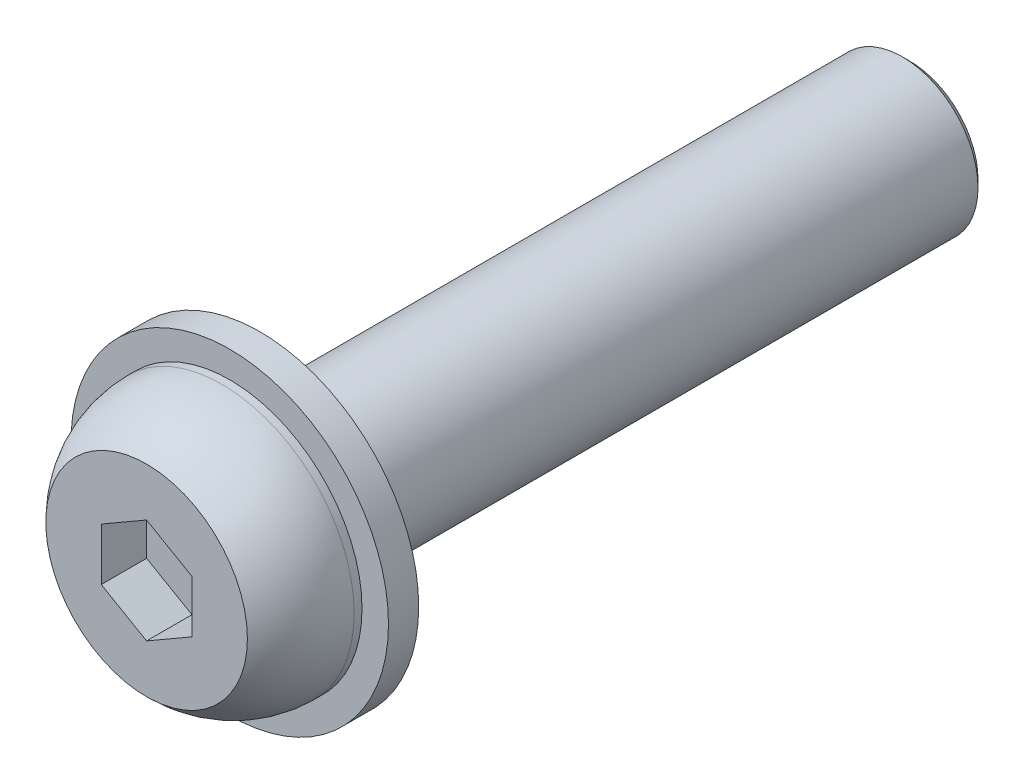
ISO-10303-21;
HEADER;
FILE_DESCRIPTION(('STEP AP214'),'2;1');
FILE_NAME('part.step','',(''),(''),'','','');
FILE_SCHEMA(('AUTOMOTIVE_DESIGN { 1 0 10303 214 1 1 1 1 }'));
ENDSEC;
DATA;
#1=APPLICATION_CONTEXT('core data for automotive mechanical design processes');
#2=APPLICATION_PROTOCOL_DEFINITION('international standard','automotive_design',2000,#1);
#3=PRODUCT_CONTEXT('',#1,'mechanical');
#4=PRODUCT('Part','Part','',(#3));
#5=PRODUCT_RELATED_PRODUCT_CATEGORY('part','',(#4));
#6=PRODUCT_DEFINITION_FORMATION('','',#4);
#7=PRODUCT_DEFINITION_CONTEXT('part definition',#1,'design');
#8=PRODUCT_DEFINITION('design','',#6,#7);
#9=PRODUCT_DEFINITION_SHAPE('','',#8);
#10=(LENGTH_UNIT() NAMED_UNIT(*) SI_UNIT(.MILLI.,.METRE.));
#11=(NAMED_UNIT(*) PLANE_ANGLE_UNIT() SI_UNIT($,.RADIAN.));
#12=(NAMED_UNIT(*) SI_UNIT($,.STERADIAN.) SOLID_ANGLE_UNIT());
#13=UNCERTAINTY_MEASURE_WITH_UNIT(LENGTH_MEASURE(1.E-05),#10,'distance_accuracy_value','');
#14=(GEOMETRIC_REPRESENTATION_CONTEXT(3) GLOBAL_UNCERTAINTY_ASSIGNED_CONTEXT((#13)) GLOBAL_UNIT_ASSIGNED_CONTEXT((#10,
#11,#12)) REPRESENTATION_CONTEXT('',''));
#15=CARTESIAN_POINT('',(0.,0.,0.));
#16=DIRECTION('',(0.,0.,1.));
#17=DIRECTION('',(1.,0.,0.));
#18=AXIS2_PLACEMENT_3D('',#15,#16,#17);
#19=CARTESIAN_POINT('',(0.,0.,2.));
#20=DIRECTION('',(0.,0.,-1.));
#21=DIRECTION('',(-1.,0.,0.));
#22=AXIS2_PLACEMENT_3D('',#19,#20,#21);
#23=CYLINDRICAL_SURFACE('',#22,10.5);
#24=CARTESIAN_POINT('',(0.,0.,2.));
#25=DIRECTION('',(0.,0.,1.));
#26=DIRECTION('',(1.,0.,0.));
#27=AXIS2_PLACEMENT_3D('',#24,#25,#26);
#28=CIRCLE('',#27,10.5);
#29=CARTESIAN_POINT('',(10.5,0.,2.));
#30=VERTEX_POINT('',#29);
#31=EDGE_CURVE('E23',#30,#30,#28,.T.);
#32=ORIENTED_EDGE('',*,*,#31,.F.);
#33=EDGE_LOOP('',(#32));
#34=FACE_BOUND('',#33,.T.);
#35=CARTESIAN_POINT('',(0.,0.,0.));
#36=DIRECTION('',(0.,0.,1.));
#37=DIRECTION('',(1.,0.,0.));
#38=AXIS2_PLACEMENT_3D('',#35,#36,#37);
#39=CIRCLE('',#38,10.5);
#40=CARTESIAN_POINT('',(10.5,0.,0.));
#41=VERTEX_POINT('',#40);
#42=EDGE_CURVE('E147',#41,#41,#39,.T.);
#43=ORIENTED_EDGE('',*,*,#42,.T.);
#44=EDGE_LOOP('',(#43));
#45=FACE_BOUND('',#44,.T.);
#46=ADVANCED_FACE('F14',(#34,#45),#23,.T.);
#47=CARTESIAN_POINT('',(0.,0.,2.));
#48=DIRECTION('',(0.,0.,1.));
#49=DIRECTION('',(1.,0.,0.));
#50=AXIS2_PLACEMENT_3D('',#47,#48,#49);
#51=PLANE('',#50);
#52=ORIENTED_EDGE('',*,*,#31,.T.);
#53=EDGE_LOOP('',(#52));
#54=FACE_BOUND('',#53,.T.);
#55=CARTESIAN_POINT('',(0.,0.,2.));
#56=DIRECTION('',(0.,0.,1.));
#57=DIRECTION('',(1.,0.,0.));
#58=AXIS2_PLACEMENT_3D('',#55,#56,#57);
#59=CIRCLE('',#58,8.75);
#60=CARTESIAN_POINT('',(8.75,0.,2.));
#61=VERTEX_POINT('',#60);
#62=EDGE_CURVE('E9',#61,#61,#59,.F.);
#63=ORIENTED_EDGE('',*,*,#62,.T.);
#64=EDGE_LOOP('',(#63));
#65=FACE_BOUND('',#64,.T.);
#66=ADVANCED_FACE('F155',(#54,#65),#51,.T.);
#67=CARTESIAN_POINT('',(0.,0.,0.));
#68=DIRECTION('',(0.,0.,1.));
#69=DIRECTION('',(1.,0.,0.));
#70=AXIS2_PLACEMENT_3D('',#67,#68,#69);
#71=PLANE('',#70);
#72=ORIENTED_EDGE('',*,*,#42,.F.);
#73=EDGE_LOOP('',(#72));
#74=FACE_BOUND('',#73,.T.);
#75=CARTESIAN_POINT('',(0.,0.,0.));
#76=DIRECTION('',(0.,0.,1.));
#77=DIRECTION('',(1.,0.,0.));
#78=AXIS2_PLACEMENT_3D('',#75,#76,#77);
#79=CIRCLE('',#78,5.25);
#80=CARTESIAN_POINT('',(5.25,0.,0.));
#81=VERTEX_POINT('',#80);
#82=EDGE_CURVE('E138',#81,#81,#79,.T.);
#83=ORIENTED_EDGE('',*,*,#82,.T.);
#84=EDGE_LOOP('',(#83));
#85=FACE_BOUND('',#84,.T.);
#86=ADVANCED_FACE('F163',(#74,#85),#71,.F.);
#87=CARTESIAN_POINT('',(0.,0.,2.));
#88=DIRECTION('',(0.,0.,-1.));
#89=DIRECTION('',(-1.,0.,0.));
#90=AXIS2_PLACEMENT_3D('',#87,#88,#89);
#91=CYLINDRICAL_SURFACE('',#90,5.25);
#92=CARTESIAN_POINT('',(0.,0.,2.));
#93=DIRECTION('',(0.,0.,1.));
#94=DIRECTION('',(1.,0.,0.));
#95=AXIS2_PLACEMENT_3D('',#92,#93,#94);
#96=CIRCLE('',#95,5.25);
#97=CARTESIAN_POINT('',(5.25,0.,2.));
#98=VERTEX_POINT('',#97);
#99=EDGE_CURVE('E142',#98,#98,#96,.T.);
#100=ORIENTED_EDGE('',*,*,#99,.T.);
#101=EDGE_LOOP('',(#100));
#102=FACE_BOUND('',#101,.T.);
#103=ORIENTED_EDGE('',*,*,#82,.F.);
#104=EDGE_LOOP('',(#103));
#105=FACE_BOUND('',#104,.T.);
#106=ADVANCED_FACE('F165',(#102,#105),#91,.F.);
#107=CARTESIAN_POINT('',(-5.,0.,-43.));
#108=DIRECTION('',(0.,0.,1.));
#109=DIRECTION('',(1.,0.,0.));
#110=AXIS2_PLACEMENT_3D('',#107,#108,#109);
#111=PLANE('',#110);
#112=CARTESIAN_POINT('',(0.,0.,-43.));
#113=DIRECTION('',(0.,0.,1.));
#114=DIRECTION('',(1.,0.,0.));
#115=AXIS2_PLACEMENT_3D('',#112,#113,#114);
#116=CIRCLE('',#115,4.5);
#117=CARTESIAN_POINT('',(4.5,0.,-43.));
#118=VERTEX_POINT('',#117);
#119=EDGE_CURVE('E18',#118,#118,#116,.F.);
#120=ORIENTED_EDGE('',*,*,#119,.T.);
#121=EDGE_LOOP('',(#120));
#122=FACE_BOUND('',#121,.T.);
#123=ADVANCED_FACE('F173',(#122),#111,.F.);
#124=CARTESIAN_POINT('',(0.,0.,-42.5));
#125=DIRECTION('',(0.,0.,1.));
#126=DIRECTION('',(1.,0.,0.));
#127=AXIS2_PLACEMENT_3D('',#124,#125,#126);
#128=CONICAL_SURFACE('',#127,5.,0.785398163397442);
#129=ORIENTED_EDGE('',*,*,#119,.F.);
#130=EDGE_LOOP('',(#129));
#131=FACE_BOUND('',#130,.T.);
#132=CARTESIAN_POINT('',(0.,0.,-42.5));
#133=DIRECTION('',(0.,0.,1.));
#134=DIRECTION('',(1.,0.,0.));
#135=AXIS2_PLACEMENT_3D('',#132,#133,#134);
#136=CIRCLE('',#135,5.);
#137=CARTESIAN_POINT('',(5.,0.,-42.5));
#138=VERTEX_POINT('',#137);
#139=EDGE_CURVE('E133',#138,#138,#136,.T.);
#140=ORIENTED_EDGE('',*,*,#139,.F.);
#141=EDGE_LOOP('',(#140));
#142=FACE_BOUND('',#141,.T.);
#143=ADVANCED_FACE('F176',(#131,#142),#128,.T.);
#144=CARTESIAN_POINT('',(0.,0.,7.5));
#145=DIRECTION('',(0.,0.,1.));
#146=DIRECTION('',(1.,0.,0.));
#147=AXIS2_PLACEMENT_3D('',#144,#145,#146);
#148=CYLINDRICAL_SURFACE('',#147,5.);
#149=ORIENTED_EDGE('',*,*,#139,.T.);
#150=EDGE_LOOP('',(#149));
#151=FACE_BOUND('',#150,.T.);
#152=CARTESIAN_POINT('',(0.,0.,2.));
#153=DIRECTION('',(0.,0.,1.));
#154=DIRECTION('',(1.,0.,0.));
#155=AXIS2_PLACEMENT_3D('',#152,#153,#154);
#156=CIRCLE('',#155,5.);
#157=CARTESIAN_POINT('',(5.,0.,2.));
#158=VERTEX_POINT('',#157);
#159=EDGE_CURVE('E119',#158,#158,#156,.T.);
#160=ORIENTED_EDGE('',*,*,#159,.F.);
#161=EDGE_LOOP('',(#160));
#162=FACE_BOUND('',#161,.T.);
#163=ADVANCED_FACE('F203',(#151,#162),#148,.T.);
#164=CARTESIAN_POINT('',(-5.,0.,2.));
#165=DIRECTION('',(0.,0.,1.));
#166=DIRECTION('',(1.,0.,0.));
#167=AXIS2_PLACEMENT_3D('',#164,#165,#166);
#168=PLANE('',#167);
#169=ORIENTED_EDGE('',*,*,#99,.F.);
#170=EDGE_LOOP('',(#169));
#171=FACE_BOUND('',#170,.T.);
#172=ORIENTED_EDGE('',*,*,#159,.T.);
#173=EDGE_LOOP('',(#172));
#174=FACE_BOUND('',#173,.T.);
#175=ADVANCED_FACE('F16',(#171,#174),#168,.F.);
#176=CARTESIAN_POINT('',(-3.,5.19615242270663,4.5));
#177=DIRECTION('',(0.,0.,1.));
#178=DIRECTION('',(1.,0.,0.));
#179=AXIS2_PLACEMENT_3D('',#176,#177,#178);
#180=PLANE('',#179);
#181=DIRECTION('',(-0.866025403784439,0.5,0.));
#182=VECTOR('',#181,1.);
#183=CARTESIAN_POINT('',(3.,1.73205080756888,4.5));
#184=LINE('',#183,#182);
#185=CARTESIAN_POINT('',(3.,1.73205080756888,4.5));
#186=VERTEX_POINT('',#185);
#187=CARTESIAN_POINT('',(0.,3.46410161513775,4.5));
#188=VERTEX_POINT('',#187);
#189=EDGE_CURVE('E103',#186,#188,#184,.T.);
#190=ORIENTED_EDGE('',*,*,#189,.T.);
#191=DIRECTION('',(-0.866025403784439,-0.5,0.));
#192=VECTOR('',#191,1.);
#193=CARTESIAN_POINT('',(0.,3.46410161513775,4.5));
#194=LINE('',#193,#192);
#195=CARTESIAN_POINT('',(-3.,1.73205080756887,4.5));
#196=VERTEX_POINT('',#195);
#197=EDGE_CURVE('E106',#188,#196,#194,.T.);
#198=ORIENTED_EDGE('',*,*,#197,.T.);
#199=DIRECTION('',(0.,-1.,0.));
#200=VECTOR('',#199,1.);
#201=CARTESIAN_POINT('',(-3.,1.73205080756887,4.5));
#202=LINE('',#201,#200);
#203=CARTESIAN_POINT('',(-3.,-1.73205080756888,4.5));
#204=VERTEX_POINT('',#203);
#205=EDGE_CURVE('E77',#196,#204,#202,.T.);
#206=ORIENTED_EDGE('',*,*,#205,.T.);
#207=DIRECTION('',(0.866025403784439,-0.5,0.));
#208=VECTOR('',#207,1.);
#209=CARTESIAN_POINT('',(-3.,-1.73205080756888,4.5));
#210=LINE('',#209,#208);
#211=CARTESIAN_POINT('',(0.,-3.46410161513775,4.5));
#212=VERTEX_POINT('',#211);
#213=EDGE_CURVE('E109',#204,#212,#210,.T.);
#214=ORIENTED_EDGE('',*,*,#213,.T.);
#215=DIRECTION('',(0.866025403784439,0.5,0.));
#216=VECTOR('',#215,1.);
#217=CARTESIAN_POINT('',(0.,-3.46410161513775,4.5));
#218=LINE('',#217,#216);
#219=CARTESIAN_POINT('',(3.,-1.73205080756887,4.5));
#220=VERTEX_POINT('',#219);
#221=EDGE_CURVE('E112',#212,#220,#218,.T.);
#222=ORIENTED_EDGE('',*,*,#221,.T.);
#223=DIRECTION('',(0.,1.,0.));
#224=VECTOR('',#223,1.);
#225=CARTESIAN_POINT('',(3.,-1.73205080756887,4.5));
#226=LINE('',#225,#224);
#227=EDGE_CURVE('E115',#220,#186,#226,.T.);
#228=ORIENTED_EDGE('',*,*,#227,.T.);
#229=EDGE_LOOP('',(#190,#198,#206,#214,#222,#228));
#230=FACE_BOUND('',#229,.T.);
#231=ADVANCED_FACE('F179',(#230),#180,.T.);
#232=CARTESIAN_POINT('',(-3.,1.73205080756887,4.5));
#233=DIRECTION('',(-1.,0.,0.));
#234=DIRECTION('',(0.,-1.,0.));
#235=AXIS2_PLACEMENT_3D('',#232,#233,#234);
#236=PLANE('',#235);
#237=DIRECTION('',(0.,-1.,0.));
#238=VECTOR('',#237,1.);
#239=CARTESIAN_POINT('',(-3.,1.73205080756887,7.5));
#240=LINE('',#239,#238);
#241=CARTESIAN_POINT('',(-3.,1.73205080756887,7.5));
#242=VERTEX_POINT('',#241);
#243=CARTESIAN_POINT('',(-3.,-1.73205080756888,7.5));
#244=VERTEX_POINT('',#243);
#245=EDGE_CURVE('E74',#242,#244,#240,.T.);
#246=ORIENTED_EDGE('',*,*,#245,.T.);
#247=DIRECTION('',(0.,0.,1.));
#248=VECTOR('',#247,1.);
#249=CARTESIAN_POINT('',(-3.,-1.73205080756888,4.5));
#250=LINE('',#249,#248);
#251=EDGE_CURVE('E81',#204,#244,#250,.T.);
#252=ORIENTED_EDGE('',*,*,#251,.F.);
#253=ORIENTED_EDGE('',*,*,#205,.F.);
#254=DIRECTION('',(0.,0.,1.));
#255=VECTOR('',#254,1.);
#256=CARTESIAN_POINT('',(-3.,1.73205080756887,4.5));
#257=LINE('',#256,#255);
#258=EDGE_CURVE('E70',#196,#242,#257,.T.);
#259=ORIENTED_EDGE('',*,*,#258,.T.);
#260=EDGE_LOOP('',(#246,#252,#253,#259));
#261=FACE_BOUND('',#260,.T.);
#262=ADVANCED_FACE('F72',(#261),#236,.F.);
#263=CARTESIAN_POINT('',(-3.,-1.73205080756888,4.5));
#264=DIRECTION('',(-0.5,-0.866025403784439,0.));
#265=DIRECTION('',(0.866025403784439,-0.5,0.));
#266=AXIS2_PLACEMENT_3D('',#263,#264,#265);
#267=PLANE('',#266);
#268=DIRECTION('',(0.866025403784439,-0.5,0.));
#269=VECTOR('',#268,1.);
#270=CARTESIAN_POINT('',(-3.,-1.73205080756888,7.5));
#271=LINE('',#270,#269);
#272=CARTESIAN_POINT('',(0.,-3.46410161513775,7.5));
#273=VERTEX_POINT('',#272);
#274=EDGE_CURVE('E93',#244,#273,#271,.T.);
#275=ORIENTED_EDGE('',*,*,#274,.T.);
#276=DIRECTION('',(0.,0.,1.));
#277=VECTOR('',#276,1.);
#278=CARTESIAN_POINT('',(0.,-3.46410161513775,4.5));
#279=LINE('',#278,#277);
#280=EDGE_CURVE('E122',#212,#273,#279,.T.);
#281=ORIENTED_EDGE('',*,*,#280,.F.);
#282=ORIENTED_EDGE('',*,*,#213,.F.);
#283=ORIENTED_EDGE('',*,*,#251,.T.);
#284=EDGE_LOOP('',(#275,#281,#282,#283));
#285=FACE_BOUND('',#284,.T.);
#286=ADVANCED_FACE('F190',(#285),#267,.F.);
#287=CARTESIAN_POINT('',(0.,-3.46410161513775,4.5));
#288=DIRECTION('',(0.5,-0.866025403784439,0.));
#289=DIRECTION('',(0.866025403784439,0.5,0.));
#290=AXIS2_PLACEMENT_3D('',#287,#288,#289);
#291=PLANE('',#290);
#292=DIRECTION('',(0.866025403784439,0.5,0.));
#293=VECTOR('',#292,1.);
#294=CARTESIAN_POINT('',(0.,-3.46410161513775,7.5));
#295=LINE('',#294,#293);
#296=CARTESIAN_POINT('',(3.,-1.73205080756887,7.5));
#297=VERTEX_POINT('',#296);
#298=EDGE_CURVE('E95',#273,#297,#295,.T.);
#299=ORIENTED_EDGE('',*,*,#298,.T.);
#300=DIRECTION('',(0.,0.,1.));
#301=VECTOR('',#300,1.);
#302=CARTESIAN_POINT('',(3.,-1.73205080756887,4.5));
#303=LINE('',#302,#301);
#304=EDGE_CURVE('E120',#220,#297,#303,.T.);
#305=ORIENTED_EDGE('',*,*,#304,.F.);
#306=ORIENTED_EDGE('',*,*,#221,.F.);
#307=ORIENTED_EDGE('',*,*,#280,.T.);
#308=EDGE_LOOP('',(#299,#305,#306,#307));
#309=FACE_BOUND('',#308,.T.);
#310=ADVANCED_FACE('F187',(#309),#291,.F.);
#311=CARTESIAN_POINT('',(3.,-1.73205080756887,4.5));
#312=DIRECTION('',(1.,0.,0.));
#313=DIRECTION('',(0.,1.,0.));
#314=AXIS2_PLACEMENT_3D('',#311,#312,#313);
#315=PLANE('',#314);
#316=DIRECTION('',(0.,1.,0.));
#317=VECTOR('',#316,1.);
#318=CARTESIAN_POINT('',(3.,-1.73205080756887,7.5));
#319=LINE('',#318,#317);
#320=CARTESIAN_POINT('',(3.,1.73205080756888,7.5));
#321=VERTEX_POINT('',#320);
#322=EDGE_CURVE('E101',#297,#321,#319,.T.);
#323=ORIENTED_EDGE('',*,*,#322,.T.);
#324=DIRECTION('',(0.,0.,1.));
#325=VECTOR('',#324,1.);
#326=CARTESIAN_POINT('',(3.,1.73205080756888,4.5));
#327=LINE('',#326,#325);
#328=EDGE_CURVE('E38',#186,#321,#327,.T.);
#329=ORIENTED_EDGE('',*,*,#328,.F.);
#330=ORIENTED_EDGE('',*,*,#227,.F.);
#331=ORIENTED_EDGE('',*,*,#304,.T.);
#332=EDGE_LOOP('',(#323,#329,#330,#331));
#333=FACE_BOUND('',#332,.T.);
#334=ADVANCED_FACE('F183',(#333),#315,.F.);
#335=CARTESIAN_POINT('',(3.,1.73205080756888,4.5));
#336=DIRECTION('',(0.5,0.866025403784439,0.));
#337=DIRECTION('',(-0.866025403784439,0.5,0.));
#338=AXIS2_PLACEMENT_3D('',#335,#336,#337);
#339=PLANE('',#338);
#340=DIRECTION('',(-0.866025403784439,0.5,0.));
#341=VECTOR('',#340,1.);
#342=CARTESIAN_POINT('',(3.,1.73205080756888,7.5));
#343=LINE('',#342,#341);
#344=CARTESIAN_POINT('',(0.,3.46410161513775,7.5));
#345=VERTEX_POINT('',#344);
#346=EDGE_CURVE('E31',#321,#345,#343,.T.);
#347=ORIENTED_EDGE('',*,*,#346,.T.);
#348=DIRECTION('',(0.,0.,1.));
#349=VECTOR('',#348,1.);
#350=CARTESIAN_POINT('',(0.,3.46410161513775,4.5));
#351=LINE('',#350,#349);
#352=EDGE_CURVE('E82',#188,#345,#351,.T.);
#353=ORIENTED_EDGE('',*,*,#352,.F.);
#354=ORIENTED_EDGE('',*,*,#189,.F.);
#355=ORIENTED_EDGE('',*,*,#328,.T.);
#356=EDGE_LOOP('',(#347,#353,#354,#355));
#357=FACE_BOUND('',#356,.T.);
#358=ADVANCED_FACE('F186',(#357),#339,.F.);
#359=CARTESIAN_POINT('',(0.,3.46410161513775,4.5));
#360=DIRECTION('',(-0.5,0.866025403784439,0.));
#361=DIRECTION('',(-0.866025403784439,-0.5,0.));
#362=AXIS2_PLACEMENT_3D('',#359,#360,#361);
#363=PLANE('',#362);
#364=DIRECTION('',(-0.866025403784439,-0.5,0.));
#365=VECTOR('',#364,1.);
#366=CARTESIAN_POINT('',(0.,3.46410161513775,7.5));
#367=LINE('',#366,#365);
#368=EDGE_CURVE('E85',#345,#242,#367,.T.);
#369=ORIENTED_EDGE('',*,*,#368,.T.);
#370=ORIENTED_EDGE('',*,*,#258,.F.);
#371=ORIENTED_EDGE('',*,*,#197,.F.);
#372=ORIENTED_EDGE('',*,*,#352,.T.);
#373=EDGE_LOOP('',(#369,#370,#371,#372));
#374=FACE_BOUND('',#373,.T.);
#375=ADVANCED_FACE('F86',(#374),#363,.F.);
#376=CARTESIAN_POINT('',(0.,0.,7.5));
#377=DIRECTION('',(0.,0.,-1.));
#378=DIRECTION('',(-1.,0.,0.));
#379=AXIS2_PLACEMENT_3D('',#376,#377,#378);
#380=PLANE('',#379);
#381=ORIENTED_EDGE('',*,*,#368,.F.);
#382=ORIENTED_EDGE('',*,*,#346,.F.);
#383=ORIENTED_EDGE('',*,*,#322,.F.);
#384=ORIENTED_EDGE('',*,*,#298,.F.);
#385=ORIENTED_EDGE('',*,*,#274,.F.);
#386=ORIENTED_EDGE('',*,*,#245,.F.);
#387=EDGE_LOOP('',(#381,#382,#383,#384,#385,#386));
#388=FACE_BOUND('',#387,.T.);
#389=CARTESIAN_POINT('',(0.,0.,7.5));
#390=DIRECTION('',(0.,0.,1.));
#391=DIRECTION('',(1.,0.,0.));
#392=AXIS2_PLACEMENT_3D('',#389,#390,#391);
#393=CIRCLE('',#392,6.66774468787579);
#394=CARTESIAN_POINT('',(6.66774468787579,0.,7.5));
#395=VERTEX_POINT('',#394);
#396=EDGE_CURVE('E128',#395,#395,#393,.T.);
#397=ORIENTED_EDGE('',*,*,#396,.T.);
#398=EDGE_LOOP('',(#397));
#399=FACE_BOUND('',#398,.T.);
#400=ADVANCED_FACE('F89',(#388,#399),#380,.F.);
#401=CARTESIAN_POINT('',(0.,0.,2.51845534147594));
#402=DIRECTION('',(0.,0.,1.));
#403=DIRECTION('',(1.,0.,0.));
#404=AXIS2_PLACEMENT_3D('',#401,#402,#403);
#405=DEGENERATE_TOROIDAL_SURFACE('',#404,1.75,7.,.T.);
#406=ORIENTED_EDGE('',*,*,#396,.F.);
#407=EDGE_LOOP('',(#406));
#408=FACE_BOUND('',#407,.T.);
#409=CARTESIAN_POINT('',(0.,0.,2.51845534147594));
#410=DIRECTION('',(0.,0.,1.));
#411=DIRECTION('',(1.,0.,0.));
#412=AXIS2_PLACEMENT_3D('',#409,#410,#411);
#413=CIRCLE('',#412,8.75);
#414=CARTESIAN_POINT('',(8.75,0.,2.51845534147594));
#415=VERTEX_POINT('',#414);
#416=EDGE_CURVE('E131',#415,#415,#413,.T.);
#417=ORIENTED_EDGE('',*,*,#416,.T.);
#418=EDGE_LOOP('',(#417));
#419=FACE_BOUND('',#418,.T.);
#420=ADVANCED_FACE('F211',(#408,#419),#405,.T.);
#421=CARTESIAN_POINT('',(0.,0.,7.5));
#422=DIRECTION('',(0.,0.,1.));
#423=DIRECTION('',(1.,0.,0.));
#424=AXIS2_PLACEMENT_3D('',#421,#422,#423);
#425=CYLINDRICAL_SURFACE('',#424,8.75);
#426=ORIENTED_EDGE('',*,*,#416,.F.);
#427=EDGE_LOOP('',(#426));
#428=FACE_BOUND('',#427,.T.);
#429=ORIENTED_EDGE('',*,*,#62,.F.);
#430=EDGE_LOOP('',(#429));
#431=FACE_BOUND('',#430,.T.);
#432=ADVANCED_FACE('F213',(#428,#431),#425,.T.);
#433=CLOSED_SHELL('',(#46,#66,#86,#106,#123,#143,#163,#175,#231,#262,#286,#310,#334,#358,#375,
#400,#420,#432));
#434=MANIFOLD_SOLID_BREP('B1',#433);
#435=ADVANCED_BREP_SHAPE_REPRESENTATION('',(#18,#434),#14);
#436=SHAPE_DEFINITION_REPRESENTATION(#9,#435);
ENDSEC;
END-ISO-10303-21;
